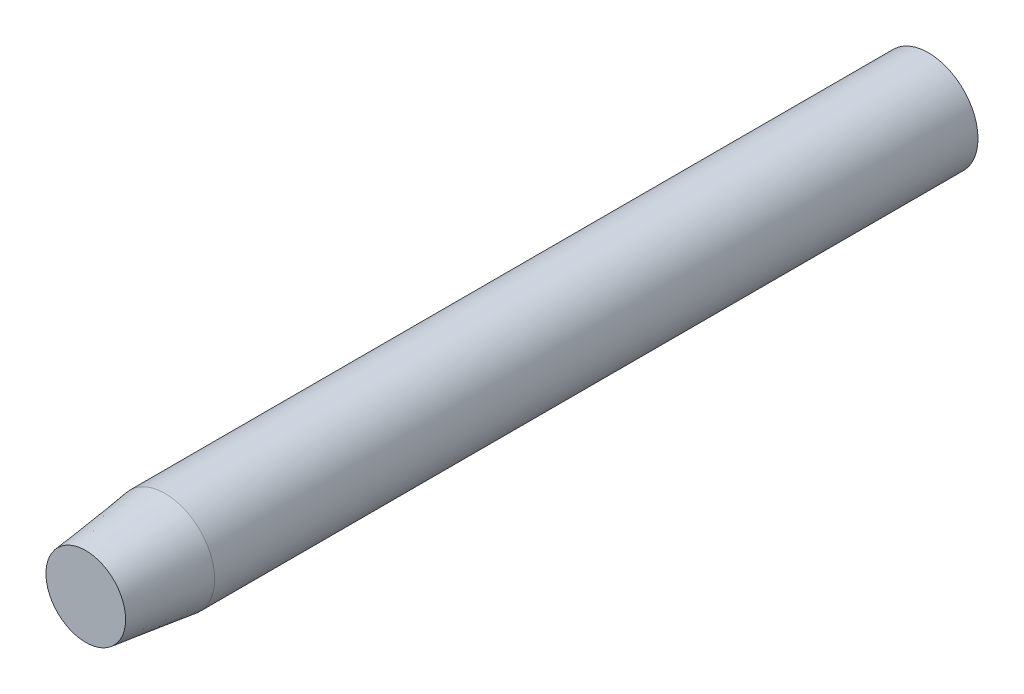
ISO-10303-21;
HEADER;
FILE_DESCRIPTION(('STEP AP214'),'2;1');
FILE_NAME('part.step','',(''),(''),'','','');
FILE_SCHEMA(('AUTOMOTIVE_DESIGN { 1 0 10303 214 1 1 1 1 }'));
ENDSEC;
DATA;
#1=APPLICATION_CONTEXT('core data for automotive mechanical design processes');
#2=APPLICATION_PROTOCOL_DEFINITION('international standard','automotive_design',2000,#1);
#3=PRODUCT_CONTEXT('',#1,'mechanical');
#4=PRODUCT('Part','Part','',(#3));
#5=PRODUCT_RELATED_PRODUCT_CATEGORY('part','',(#4));
#6=PRODUCT_DEFINITION_FORMATION('','',#4);
#7=PRODUCT_DEFINITION_CONTEXT('part definition',#1,'design');
#8=PRODUCT_DEFINITION('design','',#6,#7);
#9=PRODUCT_DEFINITION_SHAPE('','',#8);
#10=(LENGTH_UNIT() NAMED_UNIT(*) SI_UNIT(.MILLI.,.METRE.));
#11=(NAMED_UNIT(*) PLANE_ANGLE_UNIT() SI_UNIT($,.RADIAN.));
#12=(NAMED_UNIT(*) SI_UNIT($,.STERADIAN.) SOLID_ANGLE_UNIT());
#13=UNCERTAINTY_MEASURE_WITH_UNIT(LENGTH_MEASURE(1.E-05),#10,'distance_accuracy_value','');
#14=(GEOMETRIC_REPRESENTATION_CONTEXT(3) GLOBAL_UNCERTAINTY_ASSIGNED_CONTEXT((#13)) GLOBAL_UNIT_ASSIGNED_CONTEXT((#10,
#11,#12)) REPRESENTATION_CONTEXT('',''));
#15=CARTESIAN_POINT('',(0.,0.,0.));
#16=DIRECTION('',(0.,0.,1.));
#17=DIRECTION('',(1.,0.,0.));
#18=AXIS2_PLACEMENT_3D('',#15,#16,#17);
#19=CARTESIAN_POINT('',(0.,0.,107.95));
#20=DIRECTION('',(0.,0.,-1.));
#21=DIRECTION('',(-1.,0.,0.));
#22=AXIS2_PLACEMENT_3D('',#19,#20,#21);
#23=CYLINDRICAL_SURFACE('',#22,6.35);
#24=CARTESIAN_POINT('',(0.,0.,97.7899999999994));
#25=DIRECTION('',(0.,0.,1.));
#26=DIRECTION('',(1.,0.,0.));
#27=AXIS2_PLACEMENT_3D('',#24,#25,#26);
#28=CIRCLE('',#27,6.35);
#29=CARTESIAN_POINT('',(6.35,0.,97.7899999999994));
#30=VERTEX_POINT('',#29);
#31=EDGE_CURVE('E10',#30,#30,#28,.F.);
#32=ORIENTED_EDGE('',*,*,#31,.T.);
#33=EDGE_LOOP('',(#32));
#34=FACE_BOUND('',#33,.T.);
#35=CARTESIAN_POINT('',(0.,0.,0.));
#36=DIRECTION('',(0.,0.,1.));
#37=DIRECTION('',(1.,0.,0.));
#38=AXIS2_PLACEMENT_3D('',#35,#36,#37);
#39=CIRCLE('',#38,6.35);
#40=CARTESIAN_POINT('',(6.35,0.,0.));
#41=VERTEX_POINT('',#40);
#42=EDGE_CURVE('E43',#41,#41,#39,.T.);
#43=ORIENTED_EDGE('',*,*,#42,.T.);
#44=EDGE_LOOP('',(#43));
#45=FACE_BOUND('',#44,.T.);
#46=ADVANCED_FACE('F32',(#34,#45),#23,.T.);
#47=CARTESIAN_POINT('',(0.,0.,107.95));
#48=DIRECTION('',(0.,0.,1.));
#49=DIRECTION('',(1.,0.,0.));
#50=AXIS2_PLACEMENT_3D('',#47,#48,#49);
#51=PLANE('',#50);
#52=CARTESIAN_POINT('',(0.,0.,107.95));
#53=DIRECTION('',(0.,0.,1.));
#54=DIRECTION('',(1.,0.,0.));
#55=AXIS2_PLACEMENT_3D('',#52,#53,#54);
#56=CIRCLE('',#55,5.10250886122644);
#57=CARTESIAN_POINT('',(5.10250886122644,0.,107.95));
#58=VERTEX_POINT('',#57);
#59=EDGE_CURVE('E39',#58,#58,#56,.T.);
#60=ORIENTED_EDGE('',*,*,#59,.T.);
#61=EDGE_LOOP('',(#60));
#62=FACE_BOUND('',#61,.T.);
#63=ADVANCED_FACE('F53',(#62),#51,.T.);
#64=CARTESIAN_POINT('',(0.,0.,0.));
#65=DIRECTION('',(0.,0.,1.));
#66=DIRECTION('',(1.,0.,0.));
#67=AXIS2_PLACEMENT_3D('',#64,#65,#66);
#68=PLANE('',#67);
#69=ORIENTED_EDGE('',*,*,#42,.F.);
#70=EDGE_LOOP('',(#69));
#71=FACE_BOUND('',#70,.T.);
#72=ADVANCED_FACE('F51',(#71),#68,.F.);
#73=CARTESIAN_POINT('',(0.,0.,107.95));
#74=DIRECTION('',(0.,0.,-1.));
#75=DIRECTION('',(-1.,0.,0.));
#76=AXIS2_PLACEMENT_3D('',#73,#74,#75);
#77=CONICAL_SURFACE('',#76,5.10250886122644,0.1221730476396);
#78=ORIENTED_EDGE('',*,*,#31,.F.);
#79=EDGE_LOOP('',(#78));
#80=FACE_BOUND('',#79,.T.);
#81=ORIENTED_EDGE('',*,*,#59,.F.);
#82=EDGE_LOOP('',(#81));
#83=FACE_BOUND('',#82,.T.);
#84=ADVANCED_FACE('F34',(#80,#83),#77,.T.);
#85=CLOSED_SHELL('',(#46,#63,#72,#84));
#86=MANIFOLD_SOLID_BREP('B2',#85);
#87=ADVANCED_BREP_SHAPE_REPRESENTATION('',(#18,#86),#14);
#88=SHAPE_DEFINITION_REPRESENTATION(#9,#87);
ENDSEC;
END-ISO-10303-21;
